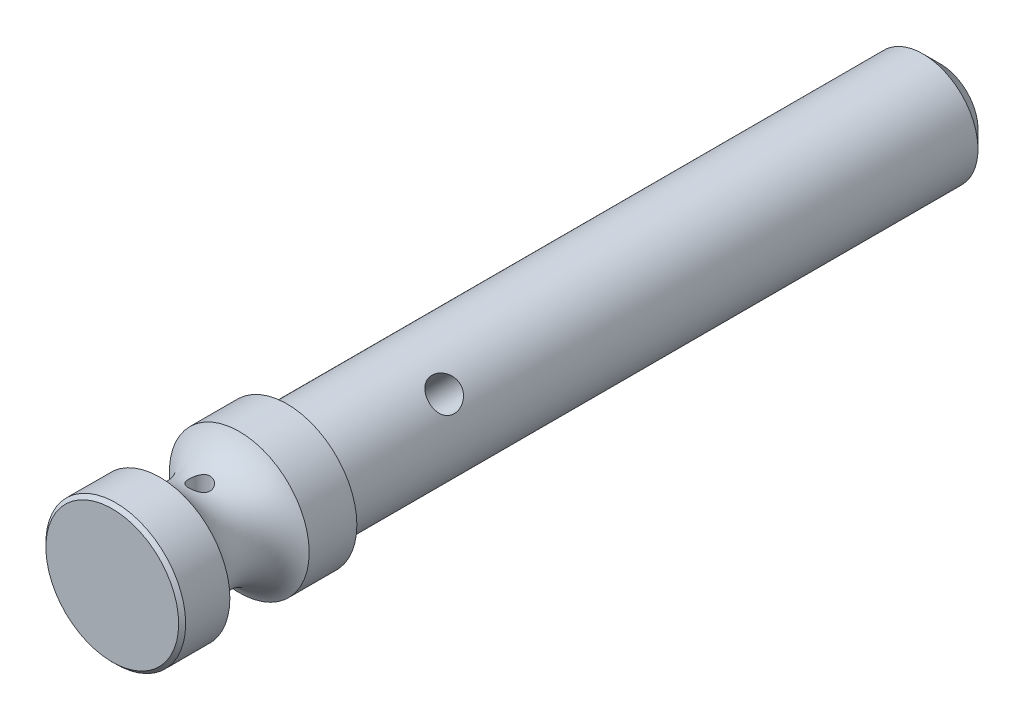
ISO-10303-21;
HEADER;
FILE_DESCRIPTION(('STEP AP214'),'2;1');
FILE_NAME('part.step','',(''),(''),'','','');
FILE_SCHEMA(('AUTOMOTIVE_DESIGN { 1 0 10303 214 1 1 1 1 }'));
ENDSEC;
DATA;
#1=APPLICATION_CONTEXT('core data for automotive mechanical design processes');
#2=APPLICATION_PROTOCOL_DEFINITION('international standard','automotive_design',2000,#1);
#3=PRODUCT_CONTEXT('',#1,'mechanical');
#4=PRODUCT('Part','Part','',(#3));
#5=PRODUCT_RELATED_PRODUCT_CATEGORY('part','',(#4));
#6=PRODUCT_DEFINITION_FORMATION('','',#4);
#7=PRODUCT_DEFINITION_CONTEXT('part definition',#1,'design');
#8=PRODUCT_DEFINITION('design','',#6,#7);
#9=PRODUCT_DEFINITION_SHAPE('','',#8);
#10=(LENGTH_UNIT() NAMED_UNIT(*) SI_UNIT(.MILLI.,.METRE.));
#11=(NAMED_UNIT(*) PLANE_ANGLE_UNIT() SI_UNIT($,.RADIAN.));
#12=(NAMED_UNIT(*) SI_UNIT($,.STERADIAN.) SOLID_ANGLE_UNIT());
#13=UNCERTAINTY_MEASURE_WITH_UNIT(LENGTH_MEASURE(1.E-05),#10,'distance_accuracy_value','');
#14=(GEOMETRIC_REPRESENTATION_CONTEXT(3) GLOBAL_UNCERTAINTY_ASSIGNED_CONTEXT((#13)) GLOBAL_UNIT_ASSIGNED_CONTEXT((#10,
#11,#12)) REPRESENTATION_CONTEXT('',''));
#15=CARTESIAN_POINT('',(0.,0.,0.));
#16=DIRECTION('',(0.,0.,1.));
#17=DIRECTION('',(1.,0.,0.));
#18=AXIS2_PLACEMENT_3D('',#15,#16,#17);
#19=CARTESIAN_POINT('',(0.,0.,-10.));
#20=DIRECTION('',(0.,0.,1.));
#21=DIRECTION('',(1.,0.,0.));
#22=AXIS2_PLACEMENT_3D('',#19,#20,#21);
#23=CYLINDRICAL_SURFACE('',#22,4.);
#24=CARTESIAN_POINT('',(0.,0.,-10.));
#25=DIRECTION('',(0.,0.,1.));
#26=DIRECTION('',(1.,0.,0.));
#27=AXIS2_PLACEMENT_3D('',#24,#25,#26);
#28=CIRCLE('',#27,4.);
#29=CARTESIAN_POINT('',(4.,0.,-10.));
#30=VERTEX_POINT('',#29);
#31=EDGE_CURVE('E130',#30,#30,#28,.T.);
#32=ORIENTED_EDGE('',*,*,#31,.T.);
#33=EDGE_LOOP('',(#32));
#34=FACE_BOUND('',#33,.T.);
#35=CARTESIAN_POINT('',(0.,0.,-7.26881026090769));
#36=DIRECTION('',(0.,0.,1.));
#37=DIRECTION('',(1.,0.,0.));
#38=AXIS2_PLACEMENT_3D('',#35,#36,#37);
#39=CIRCLE('',#38,4.);
#40=CARTESIAN_POINT('',(4.,0.,-7.26881026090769));
#41=VERTEX_POINT('',#40);
#42=EDGE_CURVE('E96',#41,#41,#39,.F.);
#43=ORIENTED_EDGE('',*,*,#42,.T.);
#44=EDGE_LOOP('',(#43));
#45=FACE_BOUND('',#44,.T.);
#46=ADVANCED_FACE('F32',(#34,#45),#23,.T.);
#47=CARTESIAN_POINT('',(0.,0.,-10.));
#48=DIRECTION('',(0.,0.,1.));
#49=DIRECTION('',(1.,0.,0.));
#50=AXIS2_PLACEMENT_3D('',#47,#48,#49);
#51=PLANE('',#50);
#52=CARTESIAN_POINT('',(0.,0.,-10.));
#53=DIRECTION('',(0.,0.,-1.));
#54=DIRECTION('',(-1.,0.,0.));
#55=AXIS2_PLACEMENT_3D('',#52,#53,#54);
#56=CIRCLE('',#55,3.15);
#57=CARTESIAN_POINT('',(-3.15,0.,-10.));
#58=VERTEX_POINT('',#57);
#59=EDGE_CURVE('E131',#58,#58,#56,.T.);
#60=ORIENTED_EDGE('',*,*,#59,.F.);
#61=EDGE_LOOP('',(#60));
#62=FACE_BOUND('',#61,.T.);
#63=ORIENTED_EDGE('',*,*,#31,.F.);
#64=EDGE_LOOP('',(#63));
#65=FACE_BOUND('',#64,.T.);
#66=ADVANCED_FACE('F116',(#62,#65),#51,.F.);
#67=CARTESIAN_POINT('',(0.,0.,-47.4));
#68=DIRECTION('',(0.,0.,1.));
#69=DIRECTION('',(1.,0.,0.));
#70=AXIS2_PLACEMENT_3D('',#67,#68,#69);
#71=CYLINDRICAL_SURFACE('',#70,3.15);
#72=CARTESIAN_POINT('',(0.,0.,-46.4));
#73=DIRECTION('',(0.,0.,-1.));
#74=DIRECTION('',(-1.,0.,0.));
#75=AXIS2_PLACEMENT_3D('',#72,#73,#74);
#76=CIRCLE('',#75,3.15);
#77=CARTESIAN_POINT('',(-3.15,0.,-46.4));
#78=VERTEX_POINT('',#77);
#79=EDGE_CURVE('E43',#78,#78,#76,.F.);
#80=ORIENTED_EDGE('',*,*,#79,.T.);
#81=EDGE_LOOP('',(#80));
#82=FACE_BOUND('',#81,.T.);
#83=CARTESIAN_POINT('',(-2.77093352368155,-1.49814131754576,-16.8));
#84=CARTESIAN_POINT('',(-2.7709333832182,-1.49814243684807,-16.7505668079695));
#85=CARTESIAN_POINT('',(-2.7689118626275,-1.50189898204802,-16.7011246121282));
#86=CARTESIAN_POINT('',(-2.76082233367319,-1.51671655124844,-16.6036779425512));
#87=CARTESIAN_POINT('',(-2.75475267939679,-1.52778054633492,-16.5556740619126));
#88=CARTESIAN_POINT('',(-2.73857169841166,-1.55659739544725,-16.4625282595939));
#89=CARTESIAN_POINT('',(-2.72846662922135,-1.57433989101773,-16.4173820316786));
#90=CARTESIAN_POINT('',(-2.70420386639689,-1.61565874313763,-16.3310244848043));
#91=CARTESIAN_POINT('',(-2.6900456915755,-1.63923579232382,-16.2898136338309));
#92=CARTESIAN_POINT('',(-2.65725367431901,-1.6918886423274,-16.2113137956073));
#93=CARTESIAN_POINT('',(-2.63851312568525,-1.7210913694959,-16.1741544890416));
#94=CARTESIAN_POINT('',(-2.59681140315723,-1.78338820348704,-16.1059637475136));
#95=CARTESIAN_POINT('',(-2.57384973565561,-1.81648276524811,-16.0749330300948));
#96=CARTESIAN_POINT('',(-2.52339943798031,-1.88595580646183,-16.0193271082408));
#97=CARTESIAN_POINT('',(-2.49583456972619,-1.92238390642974,-15.994882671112));
#98=CARTESIAN_POINT('',(-2.43686691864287,-1.99660270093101,-15.9539992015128));
#99=CARTESIAN_POINT('',(-2.4054648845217,-2.03439312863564,-15.9375586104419));
#100=CARTESIAN_POINT('',(-2.34033195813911,-2.10896469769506,-15.9135744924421));
#101=CARTESIAN_POINT('',(-2.30668324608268,-2.14574643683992,-15.9058099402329));
#102=CARTESIAN_POINT('',(-2.23723174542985,-2.21806342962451,-15.8987009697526));
#103=CARTESIAN_POINT('',(-2.20142936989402,-2.25359892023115,-15.8993549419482));
#104=CARTESIAN_POINT('',(-2.12982043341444,-2.32136305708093,-15.9089128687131));
#105=CARTESIAN_POINT('',(-2.0940439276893,-2.35365761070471,-15.9175777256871));
#106=CARTESIAN_POINT('',(-2.02262166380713,-2.41531129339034,-15.942522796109));
#107=CARTESIAN_POINT('',(-1.98697591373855,-2.44467024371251,-15.958803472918));
#108=CARTESIAN_POINT('',(-1.91660756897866,-2.50022978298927,-15.9986892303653));
#109=CARTESIAN_POINT('',(-1.88189932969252,-2.5263923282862,-16.0223724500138));
#110=CARTESIAN_POINT('',(-1.81500819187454,-2.57486974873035,-16.0763300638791));
#111=CARTESIAN_POINT('',(-1.78282584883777,-2.59718377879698,-16.1066059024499));
#112=CARTESIAN_POINT('',(-1.72107731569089,-2.63852671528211,-16.1741425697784));
#113=CARTESIAN_POINT('',(-1.69164257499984,-2.65741284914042,-16.2116112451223));
#114=CARTESIAN_POINT('',(-1.63793615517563,-2.6908490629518,-16.2918217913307));
#115=CARTESIAN_POINT('',(-1.61366489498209,-2.70539879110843,-16.334564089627));
#116=CARTESIAN_POINT('',(-1.57123600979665,-2.73026182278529,-16.4245788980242));
#117=CARTESIAN_POINT('',(-1.55312874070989,-2.74054037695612,-16.4718848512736));
#118=CARTESIAN_POINT('',(-1.52426283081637,-2.75670085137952,-16.5693989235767));
#119=CARTESIAN_POINT('',(-1.51350205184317,-2.76258405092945,-16.6196061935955));
#120=CARTESIAN_POINT('',(-1.50018193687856,-2.76983936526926,-16.7196661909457));
#121=CARTESIAN_POINT('',(-1.49735590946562,-2.77135821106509,-16.7694728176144));
#122=CARTESIAN_POINT('',(-1.49930200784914,-2.77030592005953,-16.8688897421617));
#123=CARTESIAN_POINT('',(-1.50407318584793,-2.7677352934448,-16.9185000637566));
#124=CARTESIAN_POINT('',(-1.52074373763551,-2.7586091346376,-17.0149385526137));
#125=CARTESIAN_POINT('',(-1.5324773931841,-2.75214619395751,-17.0618044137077));
#126=CARTESIAN_POINT('',(-1.56233302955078,-2.73530753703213,-17.1527108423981));
#127=CARTESIAN_POINT('',(-1.58045593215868,-2.72493125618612,-17.1967510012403));
#128=CARTESIAN_POINT('',(-1.62277258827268,-2.69994913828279,-17.2819599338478));
#129=CARTESIAN_POINT('',(-1.64710545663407,-2.68524500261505,-17.3230306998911));
#130=CARTESIAN_POINT('',(-1.70055622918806,-2.65171679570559,-17.4000643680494));
#131=CARTESIAN_POINT('',(-1.729675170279,-2.63289183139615,-17.4360261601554));
#132=CARTESIAN_POINT('',(-1.79261303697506,-2.59046792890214,-17.5030707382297));
#133=CARTESIAN_POINT('',(-1.82655747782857,-2.56672923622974,-17.5339477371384));
#134=CARTESIAN_POINT('',(-1.89703138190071,-2.51508992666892,-17.5884205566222));
#135=CARTESIAN_POINT('',(-1.93356070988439,-2.4871895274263,-17.6120167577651));
#136=CARTESIAN_POINT('',(-2.00755343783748,-2.42785059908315,-17.6510329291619));
#137=CARTESIAN_POINT('',(-2.04500741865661,-2.39644112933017,-17.6665147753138));
#138=CARTESIAN_POINT('',(-2.11976788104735,-2.33057132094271,-17.6890320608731));
#139=CARTESIAN_POINT('',(-2.15707439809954,-2.29611176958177,-17.6960696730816));
#140=CARTESIAN_POINT('',(-2.22898740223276,-2.22632838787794,-17.701346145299));
#141=CARTESIAN_POINT('',(-2.26364269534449,-2.19107722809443,-17.6998848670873));
#142=CARTESIAN_POINT('',(-2.33065304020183,-2.11965898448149,-17.6889127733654));
#143=CARTESIAN_POINT('',(-2.36300820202,-2.08349194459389,-17.6794023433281));
#144=CARTESIAN_POINT('',(-2.42438027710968,-2.01173841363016,-17.6527808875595));
#145=CARTESIAN_POINT('',(-2.45342444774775,-1.97614962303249,-17.6357385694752));
#146=CARTESIAN_POINT('',(-2.50801099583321,-1.90639571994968,-17.5945982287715));
#147=CARTESIAN_POINT('',(-2.53355283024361,-1.87223082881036,-17.5704991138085));
#148=CARTESIAN_POINT('',(-2.58154811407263,-1.80550541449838,-17.5150961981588));
#149=CARTESIAN_POINT('',(-2.60388713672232,-1.77302281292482,-17.4835994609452));
#150=CARTESIAN_POINT('',(-2.64440459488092,-1.71200715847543,-17.4146508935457));
#151=CARTESIAN_POINT('',(-2.66258187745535,-1.68347520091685,-17.3771974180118));
#152=CARTESIAN_POINT('',(-2.69515303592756,-1.6308388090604,-17.2962163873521));
#153=CARTESIAN_POINT('',(-2.70943498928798,-1.60687036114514,-17.2525551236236));
#154=CARTESIAN_POINT('',(-2.73356433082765,-1.5654723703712,-17.1611151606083));
#155=CARTESIAN_POINT('',(-2.74341420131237,-1.54803916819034,-17.1133387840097));
#156=CARTESIAN_POINT('',(-2.7576856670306,-1.52245016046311,-17.0215558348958));
#157=CARTESIAN_POINT('',(-2.76265383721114,-1.51337073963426,-16.9778893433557));
#158=CARTESIAN_POINT('',(-2.76927756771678,-1.50121628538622,-16.8894842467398));
#159=CARTESIAN_POINT('',(-2.77093365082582,-1.49814030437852,-16.8447458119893));
#160=CARTESIAN_POINT('',(-2.77093352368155,-1.49814131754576,-16.8));
#161=B_SPLINE_CURVE_WITH_KNOTS('',3,(#83,#84,#85,#86,#87,#88,#89,#90,#91,#92,#93,#94,#95,#96,
#97,#98,#99,#100,#101,#102,#103,#104,#105,#106,#107,#108,#109,#110,#111,#112,#113,#114,#115,
#116,#117,#118,#119,#120,#121,#122,#123,#124,#125,#126,#127,#128,#129,#130,#131,#132,#133,#134,
#135,#136,#137,#138,#139,#140,#141,#142,#143,#144,#145,#146,#147,#148,#149,#150,#151,#152,#153,
#154,#155,#156,#157,#158,#159,#160),.UNSPECIFIED.,.T.,.F.,(4,2,2,2,2,2,2,2,2,2,2,2,2,2,2,2,2,2,
2,2,2,2,2,2,2,2,2,2,2,2,2,2,2,2,2,2,2,2,4),(0.,0.148134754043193,0.296329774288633,
0.444295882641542,0.592279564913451,0.744107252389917,0.895952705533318,1.05062167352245,
1.20526051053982,1.35586305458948,1.50643680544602,1.65265666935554,1.79888543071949,
1.94671306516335,2.0945731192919,2.24762225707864,2.40068380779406,2.55496734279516,
2.70920595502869,2.8581946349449,3.00716472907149,3.15272380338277,3.29830388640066,
3.44748602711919,3.59670053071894,3.75095424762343,3.90519990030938,4.05825158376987,
4.21126387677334,4.35891103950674,4.50655113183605,4.65287135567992,4.79921424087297,
4.94990895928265,5.10064537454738,5.25534125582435,5.4099503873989,5.54405979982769,
5.67814804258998),.UNSPECIFIED.);
#162=CARTESIAN_POINT('',(-2.77093352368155,-1.49814131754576,-16.8));
#163=VERTEX_POINT('',#162);
#164=EDGE_CURVE('E53',#163,#163,#161,.T.);
#165=ORIENTED_EDGE('',*,*,#164,.T.);
#166=EDGE_LOOP('',(#165));
#167=FACE_BOUND('',#166,.T.);
#168=CARTESIAN_POINT('',(1.49814131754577,2.77093352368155,-16.8));
#169=CARTESIAN_POINT('',(1.49814243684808,2.77093338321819,-16.8494331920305));
#170=CARTESIAN_POINT('',(1.50189898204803,2.7689118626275,-16.8988753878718));
#171=CARTESIAN_POINT('',(1.51671655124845,2.76082233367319,-16.9963220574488));
#172=CARTESIAN_POINT('',(1.52778054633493,2.75475267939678,-17.0443259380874));
#173=CARTESIAN_POINT('',(1.55659739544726,2.73857169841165,-17.1374717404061));
#174=CARTESIAN_POINT('',(1.57433989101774,2.72846662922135,-17.1826179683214));
#175=CARTESIAN_POINT('',(1.61565874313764,2.70420386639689,-17.2689755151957));
#176=CARTESIAN_POINT('',(1.63923579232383,2.6900456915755,-17.3101863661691));
#177=CARTESIAN_POINT('',(1.69188864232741,2.65725367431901,-17.3886862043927));
#178=CARTESIAN_POINT('',(1.72109136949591,2.63851312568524,-17.4258455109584));
#179=CARTESIAN_POINT('',(1.78338820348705,2.59681140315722,-17.4940362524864));
#180=CARTESIAN_POINT('',(1.81648276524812,2.5738497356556,-17.5250669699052));
#181=CARTESIAN_POINT('',(1.88595580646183,2.52339943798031,-17.5806728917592));
#182=CARTESIAN_POINT('',(1.92238390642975,2.49583456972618,-17.605117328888));
#183=CARTESIAN_POINT('',(1.99660270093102,2.43686691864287,-17.6460007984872));
#184=CARTESIAN_POINT('',(2.03439312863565,2.4054648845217,-17.6624413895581));
#185=CARTESIAN_POINT('',(2.10896469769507,2.3403319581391,-17.6864255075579));
#186=CARTESIAN_POINT('',(2.14574643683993,2.30668324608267,-17.6941900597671));
#187=CARTESIAN_POINT('',(2.21806342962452,2.23723174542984,-17.7012990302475));
#188=CARTESIAN_POINT('',(2.25359892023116,2.20142936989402,-17.7006450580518));
#189=CARTESIAN_POINT('',(2.32136305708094,2.12982043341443,-17.6910871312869));
#190=CARTESIAN_POINT('',(2.35365761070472,2.09404392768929,-17.6824222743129));
#191=CARTESIAN_POINT('',(2.41531129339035,2.02262166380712,-17.657477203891));
#192=CARTESIAN_POINT('',(2.44467024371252,1.98697591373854,-17.641196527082));
#193=CARTESIAN_POINT('',(2.50022978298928,1.91660756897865,-17.6013107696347));
#194=CARTESIAN_POINT('',(2.5263923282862,1.88189932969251,-17.5776275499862));
#195=CARTESIAN_POINT('',(2.57486974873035,1.81500819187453,-17.5236699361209));
#196=CARTESIAN_POINT('',(2.59718377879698,1.78282584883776,-17.4933940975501));
#197=CARTESIAN_POINT('',(2.63852671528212,1.72107731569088,-17.4258574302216));
#198=CARTESIAN_POINT('',(2.65741284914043,1.69164257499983,-17.3883887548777));
#199=CARTESIAN_POINT('',(2.69084906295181,1.63793615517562,-17.3081782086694));
#200=CARTESIAN_POINT('',(2.70539879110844,1.61366489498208,-17.2654359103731));
#201=CARTESIAN_POINT('',(2.7302618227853,1.57123600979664,-17.1754211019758));
#202=CARTESIAN_POINT('',(2.74054037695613,1.55312874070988,-17.1281151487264));
#203=CARTESIAN_POINT('',(2.75670085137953,1.52426283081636,-17.0306010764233));
#204=CARTESIAN_POINT('',(2.76258405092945,1.51350205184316,-16.9803938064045));
#205=CARTESIAN_POINT('',(2.76983936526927,1.50018193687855,-16.8803338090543));
#206=CARTESIAN_POINT('',(2.77135821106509,1.49735590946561,-16.8305271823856));
#207=CARTESIAN_POINT('',(2.77030592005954,1.49930200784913,-16.7311102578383));
#208=CARTESIAN_POINT('',(2.7677352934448,1.50407318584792,-16.6814999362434));
#209=CARTESIAN_POINT('',(2.7586091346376,1.5207437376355,-16.5850614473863));
#210=CARTESIAN_POINT('',(2.75214619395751,1.53247739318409,-16.5381955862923));
#211=CARTESIAN_POINT('',(2.73530753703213,1.56233302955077,-16.4472891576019));
#212=CARTESIAN_POINT('',(2.72493125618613,1.58045593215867,-16.4032489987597));
#213=CARTESIAN_POINT('',(2.69994913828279,1.62277258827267,-16.3180400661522));
#214=CARTESIAN_POINT('',(2.68524500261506,1.64710545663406,-16.2769693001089));
#215=CARTESIAN_POINT('',(2.6517167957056,1.70055622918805,-16.1999356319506));
#216=CARTESIAN_POINT('',(2.63289183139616,1.72967517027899,-16.1639738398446));
#217=CARTESIAN_POINT('',(2.59046792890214,1.79261303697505,-16.0969292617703));
#218=CARTESIAN_POINT('',(2.56672923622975,1.82655747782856,-16.0660522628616));
#219=CARTESIAN_POINT('',(2.51508992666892,1.8970313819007,-16.0115794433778));
#220=CARTESIAN_POINT('',(2.48718952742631,1.93356070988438,-15.9879832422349));
#221=CARTESIAN_POINT('',(2.42785059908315,2.00755343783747,-15.9489670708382));
#222=CARTESIAN_POINT('',(2.39644112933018,2.0450074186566,-15.9334852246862));
#223=CARTESIAN_POINT('',(2.33057132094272,2.11976788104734,-15.9109679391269));
#224=CARTESIAN_POINT('',(2.29611176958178,2.15707439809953,-15.9039303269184));
#225=CARTESIAN_POINT('',(2.22632838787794,2.22898740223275,-15.898653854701));
#226=CARTESIAN_POINT('',(2.19107722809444,2.26364269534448,-15.9001151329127));
#227=CARTESIAN_POINT('',(2.11965898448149,2.33065304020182,-15.9110872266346));
#228=CARTESIAN_POINT('',(2.0834919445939,2.36300820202,-15.9205976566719));
#229=CARTESIAN_POINT('',(2.01173841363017,2.42438027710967,-15.9472191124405));
#230=CARTESIAN_POINT('',(1.9761496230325,2.45342444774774,-15.9642614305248));
#231=CARTESIAN_POINT('',(1.90639571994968,2.5080109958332,-16.0054017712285));
#232=CARTESIAN_POINT('',(1.87223082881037,2.5335528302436,-16.0295008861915));
#233=CARTESIAN_POINT('',(1.80550541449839,2.58154811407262,-16.0849038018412));
#234=CARTESIAN_POINT('',(1.77302281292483,2.60388713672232,-16.1164005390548));
#235=CARTESIAN_POINT('',(1.71200715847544,2.64440459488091,-16.1853491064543));
#236=CARTESIAN_POINT('',(1.68347520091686,2.66258187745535,-16.2228025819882));
#237=CARTESIAN_POINT('',(1.63083880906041,2.69515303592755,-16.3037836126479));
#238=CARTESIAN_POINT('',(1.60687036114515,2.70943498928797,-16.3474448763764));
#239=CARTESIAN_POINT('',(1.56547237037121,2.73356433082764,-16.4388848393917));
#240=CARTESIAN_POINT('',(1.54803916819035,2.74341420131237,-16.4866612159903));
#241=CARTESIAN_POINT('',(1.52245016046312,2.7576856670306,-16.5784441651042));
#242=CARTESIAN_POINT('',(1.51337073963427,2.76265383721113,-16.6221106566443));
#243=CARTESIAN_POINT('',(1.50121628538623,2.76927756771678,-16.7105157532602));
#244=CARTESIAN_POINT('',(1.49814030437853,2.77093365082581,-16.7552541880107));
#245=CARTESIAN_POINT('',(1.49814131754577,2.77093352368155,-16.8));
#246=B_SPLINE_CURVE_WITH_KNOTS('',3,(#168,#169,#170,#171,#172,#173,#174,#175,#176,#177,#178,
#179,#180,#181,#182,#183,#184,#185,#186,#187,#188,#189,#190,#191,#192,#193,#194,#195,#196,#197,
#198,#199,#200,#201,#202,#203,#204,#205,#206,#207,#208,#209,#210,#211,#212,#213,#214,#215,#216,
#217,#218,#219,#220,#221,#222,#223,#224,#225,#226,#227,#228,#229,#230,#231,#232,#233,#234,#235,
#236,#237,#238,#239,#240,#241,#242,#243,#244,#245),.UNSPECIFIED.,.T.,.F.,(4,2,2,2,2,2,2,2,2,2,2,
2,2,2,2,2,2,2,2,2,2,2,2,2,2,2,2,2,2,2,2,2,2,2,2,2,2,2,4),(0.,0.148134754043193,
0.296329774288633,0.444295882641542,0.592279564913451,0.744107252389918,0.895952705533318,
1.05062167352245,1.20526051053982,1.35586305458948,1.50643680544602,1.65265666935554,
1.79888543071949,1.94671306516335,2.0945731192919,2.24762225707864,2.40068380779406,
2.55496734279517,2.70920595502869,2.8581946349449,3.00716472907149,3.15272380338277,
3.29830388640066,3.44748602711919,3.59670053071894,3.75095424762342,3.90519990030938,
4.05825158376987,4.21126387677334,4.35891103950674,4.50655113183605,4.65287135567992,
4.79921424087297,4.94990895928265,5.10064537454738,5.25534125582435,5.4099503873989,
5.54405979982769,5.67814804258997),.UNSPECIFIED.);
#247=CARTESIAN_POINT('',(1.49814131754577,2.77093352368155,-16.8));
#248=VERTEX_POINT('',#247);
#249=EDGE_CURVE('E52',#248,#248,#246,.T.);
#250=ORIENTED_EDGE('',*,*,#249,.T.);
#251=EDGE_LOOP('',(#250));
#252=FACE_BOUND('',#251,.T.);
#253=ORIENTED_EDGE('',*,*,#59,.T.);
#254=EDGE_LOOP('',(#253));
#255=FACE_BOUND('',#254,.T.);
#256=ADVANCED_FACE('F66',(#82,#167,#252,#255),#71,.T.);
#257=CARTESIAN_POINT('',(0.,0.,-47.4));
#258=DIRECTION('',(0.,0.,-1.));
#259=DIRECTION('',(-1.,0.,0.));
#260=AXIS2_PLACEMENT_3D('',#257,#258,#259);
#261=PLANE('',#260);
#262=CARTESIAN_POINT('',(0.,0.,-47.4));
#263=DIRECTION('',(0.,0.,-1.));
#264=DIRECTION('',(-1.,0.,0.));
#265=AXIS2_PLACEMENT_3D('',#262,#263,#264);
#266=CIRCLE('',#265,2.15);
#267=CARTESIAN_POINT('',(-2.15,0.,-47.4));
#268=VERTEX_POINT('',#267);
#269=EDGE_CURVE('E47',#268,#268,#266,.T.);
#270=ORIENTED_EDGE('',*,*,#269,.T.);
#271=EDGE_LOOP('',(#270));
#272=FACE_BOUND('',#271,.T.);
#273=ADVANCED_FACE('F108',(#272),#261,.T.);
#274=CARTESIAN_POINT('',(0.,0.,-5.));
#275=DIRECTION('',(0.,0.,1.));
#276=DIRECTION('',(1.,0.,0.));
#277=AXIS2_PLACEMENT_3D('',#274,#275,#276);
#278=TOROIDAL_SURFACE('',#277,5.05,2.5);
#279=CARTESIAN_POINT('',(-0.402460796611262,-2.55846238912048,-5.44500069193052));
#280=CARTESIAN_POINT('',(-0.378173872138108,-2.56630447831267,-5.46696463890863));
#281=CARTESIAN_POINT('',(-0.352051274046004,-2.57401134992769,-5.48697335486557));
#282=CARTESIAN_POINT('',(-0.296628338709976,-2.58837535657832,-5.52258831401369));
#283=CARTESIAN_POINT('',(-0.267322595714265,-2.59503065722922,-5.5381869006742));
#284=CARTESIAN_POINT('',(-0.206125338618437,-2.60656730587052,-5.56446764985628));
#285=CARTESIAN_POINT('',(-0.174225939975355,-2.61144297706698,-5.5751341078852));
#286=CARTESIAN_POINT('',(-0.108847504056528,-2.61879056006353,-5.59100028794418));
#287=CARTESIAN_POINT('',(-0.0753701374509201,-2.62126495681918,-5.59620566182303));
#288=CARTESIAN_POINT('',(-0.0101347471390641,-2.62342152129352,-5.60074617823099));
#289=CARTESIAN_POINT('',(0.021592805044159,-2.6232754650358,-5.60044243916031));
#290=CARTESIAN_POINT('',(0.0845056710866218,-2.62062743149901,-5.59485798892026));
#291=CARTESIAN_POINT('',(0.11569096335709,-2.61812536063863,-5.58957708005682));
#292=CARTESIAN_POINT('',(0.175717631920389,-2.61115737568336,-5.57450274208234));
#293=CARTESIAN_POINT('',(0.204600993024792,-2.60675148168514,-5.56484682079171));
#294=CARTESIAN_POINT('',(0.260352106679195,-2.59643328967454,-5.54141653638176));
#295=CARTESIAN_POINT('',(0.287219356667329,-2.59052061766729,-5.52764115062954));
#296=CARTESIAN_POINT('',(0.340236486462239,-2.57727584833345,-5.49524871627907));
#297=CARTESIAN_POINT('',(0.36620139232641,-2.56987295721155,-5.47635824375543));
#298=CARTESIAN_POINT('',(0.414744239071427,-2.55467641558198,-5.43475312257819));
#299=CARTESIAN_POINT('',(0.437320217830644,-2.54688254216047,-5.41203627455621));
#300=CARTESIAN_POINT('',(0.480238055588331,-2.53105546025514,-5.36132838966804));
#301=CARTESIAN_POINT('',(0.500270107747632,-2.52305069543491,-5.33306472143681));
#302=CARTESIAN_POINT('',(0.5352913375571,-2.50838322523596,-5.27324583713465));
#303=CARTESIAN_POINT('',(0.550281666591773,-2.50172021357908,-5.2416913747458));
#304=CARTESIAN_POINT('',(0.574301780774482,-2.49074946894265,-5.17701264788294));
#305=CARTESIAN_POINT('',(0.583485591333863,-2.48638144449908,-5.14395635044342));
#306=CARTESIAN_POINT('',(0.596084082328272,-2.48033284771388,-5.07653262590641));
#307=CARTESIAN_POINT('',(0.599503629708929,-2.47865000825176,-5.04216632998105));
#308=CARTESIAN_POINT('',(0.600353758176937,-2.47823327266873,-4.97661128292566));
#309=CARTESIAN_POINT('',(0.598320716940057,-2.4792352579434,-4.94542974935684));
#310=CARTESIAN_POINT('',(0.58948244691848,-2.48351064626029,-4.88391374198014));
#311=CARTESIAN_POINT('',(0.582676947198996,-2.4867841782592,-4.85357931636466));
#312=CARTESIAN_POINT('',(0.564696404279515,-2.49516810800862,-4.79494590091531));
#313=CARTESIAN_POINT('',(0.553577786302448,-2.5002547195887,-4.76662599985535));
#314=CARTESIAN_POINT('',(0.527337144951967,-2.51174854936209,-4.71219944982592));
#315=CARTESIAN_POINT('',(0.51221380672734,-2.51815620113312,-4.68609353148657));
#316=CARTESIAN_POINT('',(0.476877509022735,-2.5322874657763,-4.63441761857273));
#317=CARTESIAN_POINT('',(0.456337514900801,-2.54007696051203,-4.60908918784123));
#318=CARTESIAN_POINT('',(0.41144441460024,-2.55573641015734,-4.56208361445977));
#319=CARTESIAN_POINT('',(0.387089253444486,-2.56360640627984,-4.54040845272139));
#320=CARTESIAN_POINT('',(0.333358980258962,-2.57913500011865,-4.49992562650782));
#321=CARTESIAN_POINT('',(0.303761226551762,-2.58674710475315,-4.48139362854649));
#322=CARTESIAN_POINT('',(0.241488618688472,-2.60028060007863,-4.44963368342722));
#323=CARTESIAN_POINT('',(0.208815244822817,-2.60620279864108,-4.43640320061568));
#324=CARTESIAN_POINT('',(0.143010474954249,-2.61535976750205,-4.41632969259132));
#325=CARTESIAN_POINT('',(0.109983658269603,-2.61871410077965,-4.40920037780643));
#326=CARTESIAN_POINT('',(0.0430488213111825,-2.62277613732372,-4.40059751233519));
#327=CARTESIAN_POINT('',(0.00914137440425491,-2.62348552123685,-4.39912037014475));
#328=CARTESIAN_POINT('',(-0.0554992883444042,-2.62222537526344,-4.40177206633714));
#329=CARTESIAN_POINT('',(-0.0862573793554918,-2.62047838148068,-4.40543516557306));
#330=CARTESIAN_POINT('',(-0.146660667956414,-2.61489335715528,-4.41738635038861));
#331=CARTESIAN_POINT('',(-0.176305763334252,-2.61105513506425,-4.42567485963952));
#332=CARTESIAN_POINT('',(-0.233958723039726,-2.60165290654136,-4.44663585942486));
#333=CARTESIAN_POINT('',(-0.261952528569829,-2.59607608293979,-4.45934099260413));
#334=CARTESIAN_POINT('',(-0.315485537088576,-2.58374626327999,-4.4887249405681));
#335=CARTESIAN_POINT('',(-0.341023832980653,-2.57699283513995,-4.50540521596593));
#336=CARTESIAN_POINT('',(-0.391301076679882,-2.56229561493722,-4.54395959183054));
#337=CARTESIAN_POINT('',(-0.415774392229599,-2.55429937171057,-4.5661605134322));
#338=CARTESIAN_POINT('',(-0.460787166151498,-2.53843556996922,-4.61430313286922));
#339=CARTESIAN_POINT('',(-0.481324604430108,-2.53056807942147,-4.64024673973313));
#340=CARTESIAN_POINT('',(-0.518889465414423,-2.5154080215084,-4.69674909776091));
#341=CARTESIAN_POINT('',(-0.535687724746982,-2.50816443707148,-4.72747458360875));
#342=CARTESIAN_POINT('',(-0.563777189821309,-2.49564030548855,-4.79171682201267));
#343=CARTESIAN_POINT('',(-0.575072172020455,-2.49035841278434,-4.8252316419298));
#344=CARTESIAN_POINT('',(-0.591085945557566,-2.48275753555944,-4.89178318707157));
#345=CARTESIAN_POINT('',(-0.596186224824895,-2.48026749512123,-4.92470804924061));
#346=CARTESIAN_POINT('',(-0.600851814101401,-2.47799257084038,-4.99103083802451));
#347=CARTESIAN_POINT('',(-0.600420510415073,-2.47820603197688,-5.02442846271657));
#348=CARTESIAN_POINT('',(-0.594316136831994,-2.48117544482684,-5.08787169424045));
#349=CARTESIAN_POINT('',(-0.589070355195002,-2.48372411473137,-5.11796974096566));
#350=CARTESIAN_POINT('',(-0.574157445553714,-2.49078018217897,-5.1768201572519));
#351=CARTESIAN_POINT('',(-0.564487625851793,-2.49528877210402,-5.20557169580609));
#352=CARTESIAN_POINT('',(-0.540721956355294,-2.50594734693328,-5.26188164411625));
#353=CARTESIAN_POINT('',(-0.526503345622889,-2.51214204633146,-5.28937937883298));
#354=CARTESIAN_POINT('',(-0.494172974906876,-2.52547973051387,-5.34166725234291));
#355=CARTESIAN_POINT('',(-0.476066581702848,-2.53262140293,-5.36646105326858));
#356=CARTESIAN_POINT('',(-0.439500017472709,-2.5460530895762,-5.40927135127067));
#357=CARTESIAN_POINT('',(-0.421547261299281,-2.55229949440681,-5.42773979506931));
#358=CARTESIAN_POINT('',(-0.402460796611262,-2.55846238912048,-5.44500069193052));
#359=B_SPLINE_CURVE_WITH_KNOTS('',3,(#279,#280,#281,#282,#283,#284,#285,#286,#287,#288,#289,
#290,#291,#292,#293,#294,#295,#296,#297,#298,#299,#300,#301,#302,#303,#304,#305,#306,#307,#308,
#309,#310,#311,#312,#313,#314,#315,#316,#317,#318,#319,#320,#321,#322,#323,#324,#325,#326,#327,
#328,#329,#330,#331,#332,#333,#334,#335,#336,#337,#338,#339,#340,#341,#342,#343,#344,#345,#346,
#347,#348,#349,#350,#351,#352,#353,#354,#355,#356,#357,#358),.UNSPECIFIED.,.T.,.F.,(4,2,2,2,2,2,
2,2,2,2,2,2,2,2,2,2,2,2,2,2,2,2,2,2,2,2,2,2,2,2,2,2,2,2,2,2,2,2,2,4),(0.,0.100932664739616,
0.202039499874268,0.303466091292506,0.404787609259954,0.499493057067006,0.594202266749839,
0.686121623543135,0.77806381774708,0.876505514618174,0.975003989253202,1.08115438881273,
1.1872805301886,1.29045828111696,1.39354887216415,1.48687891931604,1.58021426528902,
1.67236765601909,1.76455134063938,1.86470664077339,1.96491607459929,2.0715985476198,
2.17822993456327,2.2795299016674,2.38076549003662,2.47339788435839,2.56603876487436,
2.65937943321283,2.75275445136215,2.85430264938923,2.95590282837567,3.06262529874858,
3.16927443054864,3.2689546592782,3.36857386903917,3.46012625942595,3.55173442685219,
3.64605949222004,3.74025517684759,3.81957554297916),.UNSPECIFIED.);
#360=CARTESIAN_POINT('',(-0.402460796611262,-2.55846238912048,-5.44500069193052));
#361=VERTEX_POINT('',#360);
#362=EDGE_CURVE('E91',#361,#361,#359,.T.);
#363=ORIENTED_EDGE('',*,*,#362,.F.);
#364=EDGE_LOOP('',(#363));
#365=FACE_BOUND('',#364,.T.);
#366=CARTESIAN_POINT('',(-0.457009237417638,2.53962131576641,-5.38877057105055));
#367=CARTESIAN_POINT('',(-0.47808812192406,2.53186470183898,-5.36399050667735));
#368=CARTESIAN_POINT('',(-0.497188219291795,2.52428279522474,-5.33745225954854));
#369=CARTESIAN_POINT('',(-0.530956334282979,2.51024605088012,-5.28135205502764));
#370=CARTESIAN_POINT('',(-0.545617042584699,2.50379307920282,-5.25178521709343));
#371=CARTESIAN_POINT('',(-0.570013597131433,2.49274752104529,-5.19021962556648));
#372=CARTESIAN_POINT('',(-0.579732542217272,2.48816132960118,-5.1582129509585));
#373=CARTESIAN_POINT('',(-0.593721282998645,2.48148178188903,-5.09279725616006));
#374=CARTESIAN_POINT('',(-0.597996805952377,2.479385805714,-5.05938974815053));
#375=CARTESIAN_POINT('',(-0.600792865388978,2.47801927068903,-4.99453931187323));
#376=CARTESIAN_POINT('',(-0.59968157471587,2.47856794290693,-4.96311559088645));
#377=CARTESIAN_POINT('',(-0.592594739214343,2.48200972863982,-4.90095357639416));
#378=CARTESIAN_POINT('',(-0.586618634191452,2.48490311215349,-4.87021536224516));
#379=CARTESIAN_POINT('',(-0.570252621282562,2.49260028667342,-4.81095969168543));
#380=CARTESIAN_POINT('',(-0.559964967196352,2.49735966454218,-4.78240784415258));
#381=CARTESIAN_POINT('',(-0.535348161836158,2.50829274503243,-4.72739918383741));
#382=CARTESIAN_POINT('',(-0.521017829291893,2.5144668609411,-4.7009429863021));
#383=CARTESIAN_POINT('',(-0.487376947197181,2.52819056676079,-4.64856036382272));
#384=CARTESIAN_POINT('',(-0.467756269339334,2.53581116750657,-4.62285179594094));
#385=CARTESIAN_POINT('',(-0.4246852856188,2.55127468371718,-4.57493372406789));
#386=CARTESIAN_POINT('',(-0.401232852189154,2.55911772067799,-4.55272617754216));
#387=CARTESIAN_POINT('',(-0.349131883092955,2.57481493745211,-4.51081339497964));
#388=CARTESIAN_POINT('',(-0.320230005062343,2.58262876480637,-4.49140597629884));
#389=CARTESIAN_POINT('',(-0.259214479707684,2.59673060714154,-4.45776383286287));
#390=CARTESIAN_POINT('',(-0.227101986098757,2.60301916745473,-4.44352725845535));
#391=CARTESIAN_POINT('',(-0.161867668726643,2.61307361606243,-4.42126147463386));
#392=CARTESIAN_POINT('',(-0.128837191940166,2.6169301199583,-4.41300732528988));
#393=CARTESIAN_POINT('',(-0.0616655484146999,2.62200601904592,-4.40221053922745));
#394=CARTESIAN_POINT('',(-0.027525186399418,2.62322728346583,-4.39966385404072));
#395=CARTESIAN_POINT('',(0.0376496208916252,2.62288965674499,-4.4003751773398));
#396=CARTESIAN_POINT('',(0.0686920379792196,2.62156681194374,-4.40314031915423));
#397=CARTESIAN_POINT('',(0.129809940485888,2.61675181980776,-4.41339148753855));
#398=CARTESIAN_POINT('',(0.159885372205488,2.61325955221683,-4.42087777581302));
#399=CARTESIAN_POINT('',(0.218194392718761,2.60449353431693,-4.44023869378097));
#400=CARTESIAN_POINT('',(0.246433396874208,2.59922533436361,-4.45209966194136));
#401=CARTESIAN_POINT('',(0.300578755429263,2.58741868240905,-4.47982838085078));
#402=CARTESIAN_POINT('',(0.326484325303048,2.58087980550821,-4.49569747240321));
#403=CARTESIAN_POINT('',(0.377563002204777,2.56653620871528,-4.53253926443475));
#404=CARTESIAN_POINT('',(0.40249039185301,2.55867125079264,-4.55382936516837));
#405=CARTESIAN_POINT('',(0.448565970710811,2.54291850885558,-4.60017827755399));
#406=CARTESIAN_POINT('',(0.469712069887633,2.53503071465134,-4.6252391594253));
#407=CARTESIAN_POINT('',(0.508866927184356,2.51958728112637,-4.68022010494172));
#408=CARTESIAN_POINT('',(0.526615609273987,2.51207900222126,-4.71034008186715));
#409=CARTESIAN_POINT('',(0.556717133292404,2.49886395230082,-4.77352992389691));
#410=CARTESIAN_POINT('',(0.569073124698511,2.49315613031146,-4.80659805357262));
#411=CARTESIAN_POINT('',(0.587311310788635,2.48457626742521,-4.87281030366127));
#412=CARTESIAN_POINT('',(0.593517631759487,2.48156317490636,-4.90584621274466));
#413=CARTESIAN_POINT('',(0.600311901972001,2.47825959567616,-4.97261759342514));
#414=CARTESIAN_POINT('',(0.600903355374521,2.47796741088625,-5.00635261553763));
#415=CARTESIAN_POINT('',(0.596640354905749,2.48004602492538,-5.07044080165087));
#416=CARTESIAN_POINT('',(0.592252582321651,2.48218864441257,-5.10083406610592));
#417=CARTESIAN_POINT('',(0.5789690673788,2.48851942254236,-5.16039351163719));
#418=CARTESIAN_POINT('',(0.570072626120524,2.49270789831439,-5.18955950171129));
#419=CARTESIAN_POINT('',(0.547906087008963,2.50276832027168,-5.24647250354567));
#420=CARTESIAN_POINT('',(0.534560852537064,2.50866894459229,-5.2741849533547));
#421=CARTESIAN_POINT('',(0.503940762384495,2.52153168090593,-5.32707571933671));
#422=CARTESIAN_POINT('',(0.486664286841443,2.52849423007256,-5.35225298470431));
#423=CARTESIAN_POINT('',(0.44677205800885,2.54352529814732,-5.40187219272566));
#424=CARTESIAN_POINT('',(0.423806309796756,2.55163618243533,-5.42602055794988));
#425=CARTESIAN_POINT('',(0.37412963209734,2.56753474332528,-5.47024850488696));
#426=CARTESIAN_POINT('',(0.347417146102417,2.57532228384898,-5.49032638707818));
#427=CARTESIAN_POINT('',(0.289672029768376,2.5900412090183,-5.52659005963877));
#428=CARTESIAN_POINT('',(0.258510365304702,2.59692658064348,-5.54259062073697));
#429=CARTESIAN_POINT('',(0.193542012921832,2.60861265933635,-5.56900672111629));
#430=CARTESIAN_POINT('',(0.15973724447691,2.61341486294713,-5.57942627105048));
#431=CARTESIAN_POINT('',(0.0930554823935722,2.62004178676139,-5.59364761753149));
#432=CARTESIAN_POINT('',(0.0602880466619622,2.62205663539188,-5.59787331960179));
#433=CARTESIAN_POINT('',(-0.00554376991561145,2.62348456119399,-5.6008773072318));
#434=CARTESIAN_POINT('',(-0.0386079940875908,2.62289893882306,-5.5996583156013));
#435=CARTESIAN_POINT('',(-0.10163388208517,2.61933646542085,-5.59212076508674));
#436=CARTESIAN_POINT('',(-0.131650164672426,2.6165307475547,-5.58616701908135));
#437=CARTESIAN_POINT('',(-0.190226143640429,2.60904033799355,-5.56985877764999));
#438=CARTESIAN_POINT('',(-0.218784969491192,2.60435453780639,-5.55950168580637));
#439=CARTESIAN_POINT('',(-0.274759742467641,2.59337432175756,-5.53430578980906));
#440=CARTESIAN_POINT('',(-0.30210005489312,2.58702908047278,-5.51932203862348));
#441=CARTESIAN_POINT('',(-0.353946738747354,2.5734373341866,-5.48546779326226));
#442=CARTESIAN_POINT('',(-0.37845690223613,2.56619206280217,-5.46660259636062));
#443=CARTESIAN_POINT('',(-0.421152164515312,2.55244472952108,-5.42818363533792));
#444=CARTESIAN_POINT('',(-0.439744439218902,2.54597442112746,-5.40906684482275));
#445=CARTESIAN_POINT('',(-0.457009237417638,2.53962131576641,-5.38877057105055));
#446=B_SPLINE_CURVE_WITH_KNOTS('',3,(#366,#367,#368,#369,#370,#371,#372,#373,#374,#375,#376,
#377,#378,#379,#380,#381,#382,#383,#384,#385,#386,#387,#388,#389,#390,#391,#392,#393,#394,#395,
#396,#397,#398,#399,#400,#401,#402,#403,#404,#405,#406,#407,#408,#409,#410,#411,#412,#413,#414,
#415,#416,#417,#418,#419,#420,#421,#422,#423,#424,#425,#426,#427,#428,#429,#430,#431,#432,#433,
#434,#435,#436,#437,#438,#439,#440,#441,#442,#443,#444,#445),.UNSPECIFIED.,.T.,.F.,(4,2,2,2,2,2,
2,2,2,2,2,2,2,2,2,2,2,2,2,2,2,2,2,2,2,2,2,2,2,2,2,2,2,2,2,2,2,2,2,4),(0.,0.100249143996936,
0.200662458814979,0.301416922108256,0.402065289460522,0.495935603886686,0.589816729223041,
0.68158717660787,0.773384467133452,0.872643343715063,0.971957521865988,1.07846627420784,
1.18493688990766,1.28716078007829,1.38931213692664,1.48244031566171,1.57557365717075,
1.66841858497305,1.76129461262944,1.86199777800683,1.96275643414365,2.06948421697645,
2.17614958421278,2.27683452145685,2.37745661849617,2.46937423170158,2.56130609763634,
2.65487671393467,2.74848595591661,2.8509284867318,2.9534137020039,3.05995017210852,
3.16640997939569,3.26517465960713,3.36388995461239,3.45566015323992,3.54748453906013,
3.6425417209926,3.7374700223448,3.81957973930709),.UNSPECIFIED.);
#447=CARTESIAN_POINT('',(-0.457009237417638,2.53962131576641,-5.38877057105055));
#448=VERTEX_POINT('',#447);
#449=EDGE_CURVE('E61',#448,#448,#446,.T.);
#450=ORIENTED_EDGE('',*,*,#449,.F.);
#451=EDGE_LOOP('',(#450));
#452=FACE_BOUND('',#451,.T.);
#453=CARTESIAN_POINT('',(0.,0.,-2.73118973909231));
#454=DIRECTION('',(0.,0.,-1.));
#455=DIRECTION('',(-1.,0.,0.));
#456=AXIS2_PLACEMENT_3D('',#453,#454,#455);
#457=CIRCLE('',#456,4.);
#458=CARTESIAN_POINT('',(-4.,0.,-2.73118973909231));
#459=VERTEX_POINT('',#458);
#460=EDGE_CURVE('E99',#459,#459,#457,.F.);
#461=ORIENTED_EDGE('',*,*,#460,.F.);
#462=EDGE_LOOP('',(#461));
#463=FACE_BOUND('',#462,.T.);
#464=ORIENTED_EDGE('',*,*,#42,.F.);
#465=EDGE_LOOP('',(#464));
#466=FACE_BOUND('',#465,.T.);
#467=ADVANCED_FACE('F83',(#365,#452,#463,#466),#278,.F.);
#468=CARTESIAN_POINT('',(0.,0.,0.));
#469=DIRECTION('',(0.,0.,1.));
#470=DIRECTION('',(1.,0.,0.));
#471=AXIS2_PLACEMENT_3D('',#468,#469,#470);
#472=PLANE('',#471);
#473=CARTESIAN_POINT('',(0.,0.,0.));
#474=DIRECTION('',(0.,0.,1.));
#475=DIRECTION('',(1.,0.,0.));
#476=AXIS2_PLACEMENT_3D('',#473,#474,#475);
#477=CIRCLE('',#476,3.8);
#478=CARTESIAN_POINT('',(3.8,0.,0.));
#479=VERTEX_POINT('',#478);
#480=EDGE_CURVE('E39',#479,#479,#477,.T.);
#481=ORIENTED_EDGE('',*,*,#480,.T.);
#482=EDGE_LOOP('',(#481));
#483=FACE_BOUND('',#482,.T.);
#484=ADVANCED_FACE('F107',(#483),#472,.T.);
#485=CARTESIAN_POINT('',(0.,0.,-0.200000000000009));
#486=DIRECTION('',(0.,0.,1.));
#487=DIRECTION('',(1.,0.,0.));
#488=AXIS2_PLACEMENT_3D('',#485,#486,#487);
#489=CIRCLE('',#488,4.);
#490=CARTESIAN_POINT('',(4.,0.,-0.200000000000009));
#491=VERTEX_POINT('',#490);
#492=EDGE_CURVE('E10',#491,#491,#489,.F.);
#493=ORIENTED_EDGE('',*,*,#492,.T.);
#494=EDGE_LOOP('',(#493));
#495=FACE_BOUND('',#494,.T.);
#496=ORIENTED_EDGE('',*,*,#460,.T.);
#497=EDGE_LOOP('',(#496));
#498=FACE_BOUND('',#497,.T.);
#499=ADVANCED_FACE('F81',(#495,#498),#23,.T.);
#500=CARTESIAN_POINT('',(0.,-4.,-5.));
#501=DIRECTION('',(0.,1.,0.));
#502=DIRECTION('',(0.,0.,1.));
#503=AXIS2_PLACEMENT_3D('',#500,#501,#502);
#504=CYLINDRICAL_SURFACE('',#503,0.6);
#505=ORIENTED_EDGE('',*,*,#362,.T.);
#506=EDGE_LOOP('',(#505));
#507=FACE_BOUND('',#506,.T.);
#508=ORIENTED_EDGE('',*,*,#449,.T.);
#509=EDGE_LOOP('',(#508));
#510=FACE_BOUND('',#509,.T.);
#511=ADVANCED_FACE('F75',(#507,#510),#504,.F.);
#512=CARTESIAN_POINT('',(2.22738636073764,2.22738636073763,-16.8));
#513=DIRECTION('',(0.707106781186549,0.707106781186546,0.));
#514=DIRECTION('',(-0.707106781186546,0.707106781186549,0.));
#515=AXIS2_PLACEMENT_3D('',#512,#513,#514);
#516=CYLINDRICAL_SURFACE('',#515,0.899999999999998);
#517=ORIENTED_EDGE('',*,*,#249,.F.);
#518=EDGE_LOOP('',(#517));
#519=FACE_BOUND('',#518,.T.);
#520=ORIENTED_EDGE('',*,*,#164,.F.);
#521=EDGE_LOOP('',(#520));
#522=FACE_BOUND('',#521,.T.);
#523=ADVANCED_FACE('F70',(#519,#522),#516,.F.);
#524=CARTESIAN_POINT('',(0.,0.,-47.4));
#525=DIRECTION('',(0.,0.,1.));
#526=DIRECTION('',(1.,0.,0.));
#527=AXIS2_PLACEMENT_3D('',#524,#525,#526);
#528=CONICAL_SURFACE('',#527,2.15,0.785398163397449);
#529=ORIENTED_EDGE('',*,*,#79,.F.);
#530=EDGE_LOOP('',(#529));
#531=FACE_BOUND('',#530,.T.);
#532=ORIENTED_EDGE('',*,*,#269,.F.);
#533=EDGE_LOOP('',(#532));
#534=FACE_BOUND('',#533,.T.);
#535=ADVANCED_FACE('F74',(#531,#534),#528,.T.);
#536=CARTESIAN_POINT('',(0.,0.,0.));
#537=DIRECTION('',(0.,0.,-1.));
#538=DIRECTION('',(-1.,0.,0.));
#539=AXIS2_PLACEMENT_3D('',#536,#537,#538);
#540=CONICAL_SURFACE('',#539,3.8,0.785398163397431);
#541=ORIENTED_EDGE('',*,*,#492,.F.);
#542=EDGE_LOOP('',(#541));
#543=FACE_BOUND('',#542,.T.);
#544=ORIENTED_EDGE('',*,*,#480,.F.);
#545=EDGE_LOOP('',(#544));
#546=FACE_BOUND('',#545,.T.);
#547=ADVANCED_FACE('F34',(#543,#546),#540,.T.);
#548=CLOSED_SHELL('',(#46,#66,#256,#273,#467,#484,#499,#511,#523,#535,#547));
#549=MANIFOLD_SOLID_BREP('B2',#548);
#550=ADVANCED_BREP_SHAPE_REPRESENTATION('',(#18,#549),#14);
#551=SHAPE_DEFINITION_REPRESENTATION(#9,#550);
ENDSEC;
END-ISO-10303-21;
